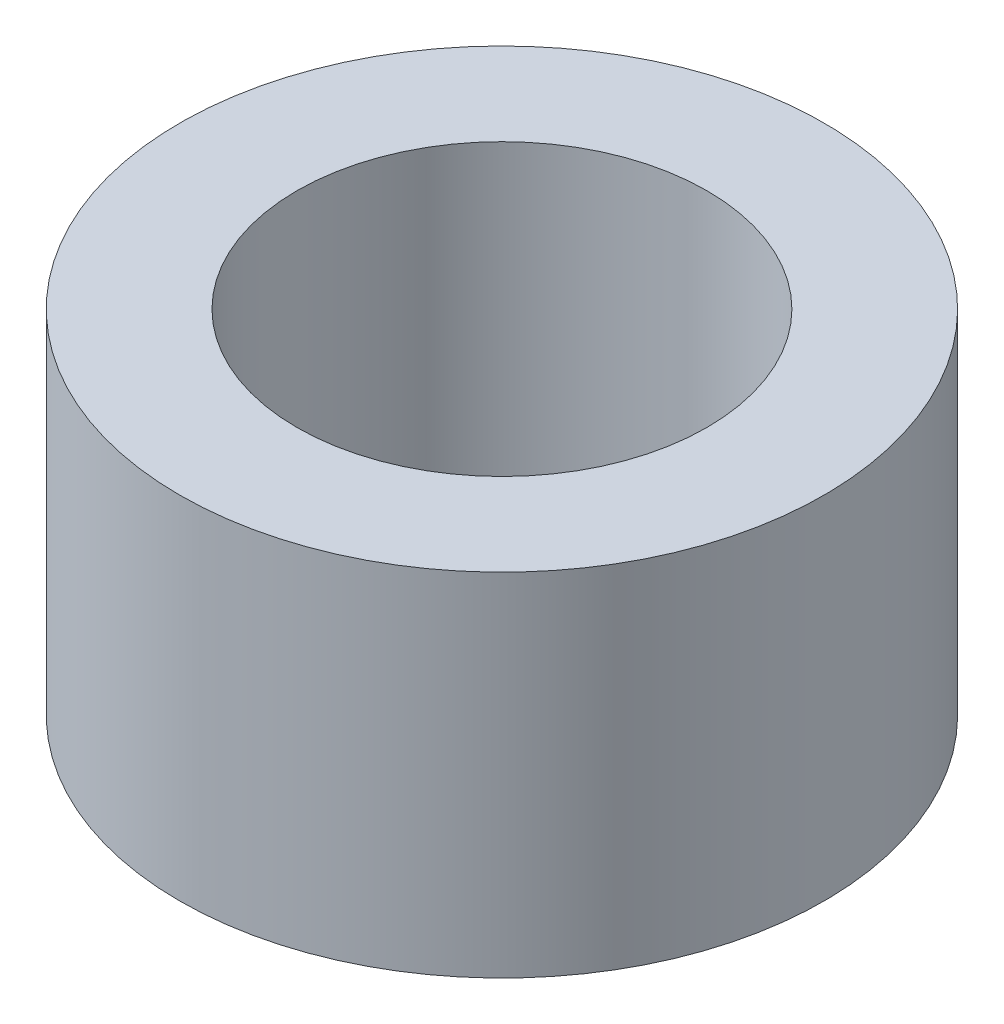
from build123d import *

# Parameters (mm, degrees)
SKETCH_1_R      = 2.75
SKETCH_1_R_2    = 1.75
EXTRUDE_1_DEPTH = 3


with BuildPart() as part:
    # Sketch 1 → Extrude 1 (new body)
    with BuildSketch(Plane(origin=(0, 0, 0), x_dir=(1, 0, 0), z_dir=(0, 1, 0))):
        with Locations(Location((0, 0, 0), (0, 0, 270))):
            Circle(SKETCH_1_R)
        with Locations(Location((0, 0, 0), (0, 0, 270))):
            Circle(SKETCH_1_R_2, mode=Mode.SUBTRACT)
    extrude(amount=EXTRUDE_1_DEPTH)


solid = part.part
